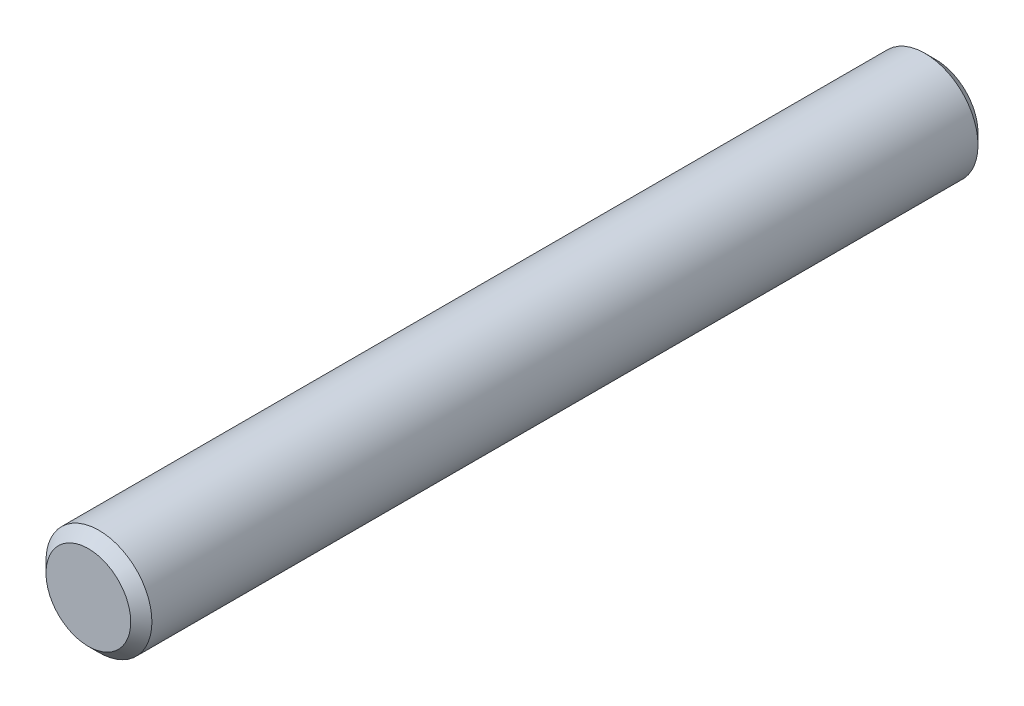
ISO-10303-21;
HEADER;
FILE_DESCRIPTION(('STEP AP214'),'2;1');
FILE_NAME('part.step','',(''),(''),'','','');
FILE_SCHEMA(('AUTOMOTIVE_DESIGN { 1 0 10303 214 1 1 1 1 }'));
ENDSEC;
DATA;
#1=APPLICATION_CONTEXT('core data for automotive mechanical design processes');
#2=APPLICATION_PROTOCOL_DEFINITION('international standard','automotive_design',2000,#1);
#3=PRODUCT_CONTEXT('',#1,'mechanical');
#4=PRODUCT('Part','Part','',(#3));
#5=PRODUCT_RELATED_PRODUCT_CATEGORY('part','',(#4));
#6=PRODUCT_DEFINITION_FORMATION('','',#4);
#7=PRODUCT_DEFINITION_CONTEXT('part definition',#1,'design');
#8=PRODUCT_DEFINITION('design','',#6,#7);
#9=PRODUCT_DEFINITION_SHAPE('','',#8);
#10=(LENGTH_UNIT() NAMED_UNIT(*) SI_UNIT(.MILLI.,.METRE.));
#11=(NAMED_UNIT(*) PLANE_ANGLE_UNIT() SI_UNIT($,.RADIAN.));
#12=(NAMED_UNIT(*) SI_UNIT($,.STERADIAN.) SOLID_ANGLE_UNIT());
#13=UNCERTAINTY_MEASURE_WITH_UNIT(LENGTH_MEASURE(1.E-05),#10,'distance_accuracy_value','');
#14=(GEOMETRIC_REPRESENTATION_CONTEXT(3) GLOBAL_UNCERTAINTY_ASSIGNED_CONTEXT((#13)) GLOBAL_UNIT_ASSIGNED_CONTEXT((#10,
#11,#12)) REPRESENTATION_CONTEXT('',''));
#15=CARTESIAN_POINT('',(0.,0.,0.));
#16=DIRECTION('',(0.,0.,1.));
#17=DIRECTION('',(1.,0.,0.));
#18=AXIS2_PLACEMENT_3D('',#15,#16,#17);
#19=CARTESIAN_POINT('',(0.,0.,-8.));
#20=DIRECTION('',(0.,0.,1.));
#21=DIRECTION('',(1.,0.,0.));
#22=AXIS2_PLACEMENT_3D('',#19,#20,#21);
#23=CYLINDRICAL_SURFACE('',#22,1.);
#24=CARTESIAN_POINT('',(0.,0.,-7.8));
#25=DIRECTION('',(0.,0.,1.));
#26=DIRECTION('',(1.,0.,0.));
#27=AXIS2_PLACEMENT_3D('',#24,#25,#26);
#28=CIRCLE('',#27,1.);
#29=CARTESIAN_POINT('',(1.,0.,-7.8));
#30=VERTEX_POINT('',#29);
#31=EDGE_CURVE('E42',#30,#30,#28,.T.);
#32=ORIENTED_EDGE('',*,*,#31,.T.);
#33=EDGE_LOOP('',(#32));
#34=FACE_BOUND('',#33,.T.);
#35=CARTESIAN_POINT('',(0.,0.,7.8));
#36=DIRECTION('',(0.,0.,1.));
#37=DIRECTION('',(1.,0.,0.));
#38=AXIS2_PLACEMENT_3D('',#35,#36,#37);
#39=CIRCLE('',#38,1.);
#40=CARTESIAN_POINT('',(1.,0.,7.8));
#41=VERTEX_POINT('',#40);
#42=EDGE_CURVE('E46',#41,#41,#39,.F.);
#43=ORIENTED_EDGE('',*,*,#42,.T.);
#44=EDGE_LOOP('',(#43));
#45=FACE_BOUND('',#44,.T.);
#46=ADVANCED_FACE('F31',(#34,#45),#23,.T.);
#47=CARTESIAN_POINT('',(0.,0.,-8.));
#48=DIRECTION('',(0.,0.,1.));
#49=DIRECTION('',(1.,0.,0.));
#50=AXIS2_PLACEMENT_3D('',#47,#48,#49);
#51=PLANE('',#50);
#52=CARTESIAN_POINT('',(0.,0.,-8.));
#53=DIRECTION('',(0.,0.,1.));
#54=DIRECTION('',(1.,0.,0.));
#55=AXIS2_PLACEMENT_3D('',#52,#53,#54);
#56=CIRCLE('',#55,0.8);
#57=CARTESIAN_POINT('',(0.799999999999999,0.,-8.));
#58=VERTEX_POINT('',#57);
#59=EDGE_CURVE('E38',#58,#58,#56,.F.);
#60=ORIENTED_EDGE('',*,*,#59,.T.);
#61=EDGE_LOOP('',(#60));
#62=FACE_BOUND('',#61,.T.);
#63=ADVANCED_FACE('F62',(#62),#51,.F.);
#64=CARTESIAN_POINT('',(0.,0.,8.));
#65=DIRECTION('',(0.,0.,1.));
#66=DIRECTION('',(1.,0.,0.));
#67=AXIS2_PLACEMENT_3D('',#64,#65,#66);
#68=PLANE('',#67);
#69=CARTESIAN_POINT('',(0.,0.,8.));
#70=DIRECTION('',(0.,0.,1.));
#71=DIRECTION('',(1.,0.,0.));
#72=AXIS2_PLACEMENT_3D('',#69,#70,#71);
#73=CIRCLE('',#72,0.799999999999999);
#74=CARTESIAN_POINT('',(0.799999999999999,0.,8.));
#75=VERTEX_POINT('',#74);
#76=EDGE_CURVE('E10',#75,#75,#73,.T.);
#77=ORIENTED_EDGE('',*,*,#76,.T.);
#78=EDGE_LOOP('',(#77));
#79=FACE_BOUND('',#78,.T.);
#80=ADVANCED_FACE('F59',(#79),#68,.T.);
#81=CARTESIAN_POINT('',(0.,0.,-7.8));
#82=DIRECTION('',(0.,0.,1.));
#83=DIRECTION('',(1.,0.,0.));
#84=AXIS2_PLACEMENT_3D('',#81,#82,#83);
#85=CONICAL_SURFACE('',#84,1.,0.785398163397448);
#86=CARTESIAN_POINT('',(0.799999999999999,0.,-8.));
#87=CARTESIAN_POINT('',(0.802083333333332,0.,-7.99791666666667));
#88=CARTESIAN_POINT('',(0.804166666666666,0.,-7.99583333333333));
#89=CARTESIAN_POINT('',(0.808333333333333,0.,-7.99166666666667));
#90=CARTESIAN_POINT('',(0.810416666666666,0.,-7.98958333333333));
#91=CARTESIAN_POINT('',(0.814583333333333,0.,-7.98541666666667));
#92=CARTESIAN_POINT('',(0.816666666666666,0.,-7.98333333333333));
#93=CARTESIAN_POINT('',(0.820833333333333,0.,-7.97916666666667));
#94=CARTESIAN_POINT('',(0.822916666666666,0.,-7.97708333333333));
#95=CARTESIAN_POINT('',(0.827083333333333,0.,-7.97291666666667));
#96=CARTESIAN_POINT('',(0.829166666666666,0.,-7.97083333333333));
#97=CARTESIAN_POINT('',(0.833333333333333,0.,-7.96666666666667));
#98=CARTESIAN_POINT('',(0.835416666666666,0.,-7.96458333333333));
#99=CARTESIAN_POINT('',(0.839583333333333,0.,-7.96041666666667));
#100=CARTESIAN_POINT('',(0.841666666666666,0.,-7.95833333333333));
#101=CARTESIAN_POINT('',(0.845833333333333,0.,-7.95416666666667));
#102=CARTESIAN_POINT('',(0.847916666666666,0.,-7.95208333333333));
#103=CARTESIAN_POINT('',(0.852083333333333,0.,-7.94791666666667));
#104=CARTESIAN_POINT('',(0.854166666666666,0.,-7.94583333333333));
#105=CARTESIAN_POINT('',(0.858333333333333,0.,-7.94166666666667));
#106=CARTESIAN_POINT('',(0.860416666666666,0.,-7.93958333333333));
#107=CARTESIAN_POINT('',(0.864583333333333,0.,-7.93541666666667));
#108=CARTESIAN_POINT('',(0.866666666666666,0.,-7.93333333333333));
#109=CARTESIAN_POINT('',(0.870833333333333,0.,-7.92916666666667));
#110=CARTESIAN_POINT('',(0.872916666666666,0.,-7.92708333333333));
#111=CARTESIAN_POINT('',(0.877083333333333,0.,-7.92291666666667));
#112=CARTESIAN_POINT('',(0.879166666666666,0.,-7.92083333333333));
#113=CARTESIAN_POINT('',(0.883333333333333,0.,-7.91666666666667));
#114=CARTESIAN_POINT('',(0.885416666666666,0.,-7.91458333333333));
#115=CARTESIAN_POINT('',(0.889583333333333,0.,-7.91041666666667));
#116=CARTESIAN_POINT('',(0.891666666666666,0.,-7.90833333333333));
#117=CARTESIAN_POINT('',(0.895833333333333,0.,-7.90416666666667));
#118=CARTESIAN_POINT('',(0.897916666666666,0.,-7.90208333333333));
#119=CARTESIAN_POINT('',(0.902083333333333,0.,-7.89791666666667));
#120=CARTESIAN_POINT('',(0.904166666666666,0.,-7.89583333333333));
#121=CARTESIAN_POINT('',(0.908333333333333,0.,-7.89166666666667));
#122=CARTESIAN_POINT('',(0.910416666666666,0.,-7.88958333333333));
#123=CARTESIAN_POINT('',(0.914583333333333,0.,-7.88541666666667));
#124=CARTESIAN_POINT('',(0.916666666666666,0.,-7.88333333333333));
#125=CARTESIAN_POINT('',(0.920833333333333,0.,-7.87916666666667));
#126=CARTESIAN_POINT('',(0.922916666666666,0.,-7.87708333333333));
#127=CARTESIAN_POINT('',(0.927083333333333,0.,-7.87291666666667));
#128=CARTESIAN_POINT('',(0.929166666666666,0.,-7.87083333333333));
#129=CARTESIAN_POINT('',(0.933333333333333,0.,-7.86666666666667));
#130=CARTESIAN_POINT('',(0.935416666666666,0.,-7.86458333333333));
#131=CARTESIAN_POINT('',(0.939583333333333,0.,-7.86041666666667));
#132=CARTESIAN_POINT('',(0.941666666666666,0.,-7.85833333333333));
#133=CARTESIAN_POINT('',(0.945833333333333,0.,-7.85416666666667));
#134=CARTESIAN_POINT('',(0.947916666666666,0.,-7.85208333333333));
#135=CARTESIAN_POINT('',(0.952083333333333,0.,-7.84791666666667));
#136=CARTESIAN_POINT('',(0.954166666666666,0.,-7.84583333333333));
#137=CARTESIAN_POINT('',(0.958333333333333,0.,-7.84166666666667));
#138=CARTESIAN_POINT('',(0.960416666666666,0.,-7.83958333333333));
#139=CARTESIAN_POINT('',(0.964583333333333,0.,-7.83541666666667));
#140=CARTESIAN_POINT('',(0.966666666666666,0.,-7.83333333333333));
#141=CARTESIAN_POINT('',(0.970833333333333,0.,-7.82916666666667));
#142=CARTESIAN_POINT('',(0.972916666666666,0.,-7.82708333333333));
#143=CARTESIAN_POINT('',(0.977083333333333,0.,-7.82291666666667));
#144=CARTESIAN_POINT('',(0.979166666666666,0.,-7.82083333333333));
#145=CARTESIAN_POINT('',(0.983333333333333,0.,-7.81666666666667));
#146=CARTESIAN_POINT('',(0.985416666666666,0.,-7.81458333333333));
#147=CARTESIAN_POINT('',(0.989583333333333,0.,-7.81041666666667));
#148=CARTESIAN_POINT('',(0.991666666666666,0.,-7.80833333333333));
#149=CARTESIAN_POINT('',(0.995833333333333,0.,-7.80416666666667));
#150=CARTESIAN_POINT('',(0.997916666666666,0.,-7.80208333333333));
#151=CARTESIAN_POINT('',(1.,0.,-7.8));
#152=B_SPLINE_CURVE_WITH_KNOTS('',3,(#86,#87,#88,#89,#90,#91,#92,#93,#94,#95,#96,#97,#98,#99,
#100,#101,#102,#103,#104,#105,#106,#107,#108,#109,#110,#111,#112,#113,#114,#115,#116,#117,#118,
#119,#120,#121,#122,#123,#124,#125,#126,#127,#128,#129,#130,#131,#132,#133,#134,#135,#136,#137,
#138,#139,#140,#141,#142,#143,#144,#145,#146,#147,#148,#149,#150,#151),.UNSPECIFIED.,.F.,.F.,(4,
2,2,2,2,2,2,2,2,2,2,2,2,2,2,2,2,2,2,2,2,2,2,2,2,2,2,2,2,2,2,2,4),(0.,0.00883883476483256,
0.0176776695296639,0.0265165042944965,0.0353553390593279,0.0441941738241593,0.0530330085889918,
0.0618718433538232,0.0707106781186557,0.0795495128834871,0.0883883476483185,0.0972271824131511,
0.106066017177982,0.114904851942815,0.123743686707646,0.132582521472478,0.14142135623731,
0.150260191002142,0.159099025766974,0.167937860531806,0.176776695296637,0.18561553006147,
0.194454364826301,0.203293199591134,0.212132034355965,0.220970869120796,0.229809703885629,
0.23864853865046,0.247487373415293,0.256326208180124,0.265165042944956,0.274003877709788,
0.28284271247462),.UNSPECIFIED.);
#153=EDGE_CURVE('BSEAM55',#58,#30,#152,.T.);
#154=ORIENTED_EDGE('',*,*,#59,.F.);
#155=ORIENTED_EDGE('',*,*,#31,.F.);
#156=ORIENTED_EDGE('',*,*,#153,.T.);
#157=ORIENTED_EDGE('',*,*,#153,.F.);
#158=EDGE_LOOP('',(#154,#156,#155,#157));
#159=FACE_BOUND('',#158,.T.);
#160=ADVANCED_FACE('F55',(#159),#85,.T.);
#161=CARTESIAN_POINT('',(0.,0.,8.));
#162=DIRECTION('',(0.,0.,-1.));
#163=DIRECTION('',(-1.,0.,0.));
#164=AXIS2_PLACEMENT_3D('',#161,#162,#163);
#165=CONICAL_SURFACE('',#164,0.799999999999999,0.785398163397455);
#166=ORIENTED_EDGE('',*,*,#42,.F.);
#167=EDGE_LOOP('',(#166));
#168=FACE_BOUND('',#167,.T.);
#169=ORIENTED_EDGE('',*,*,#76,.F.);
#170=EDGE_LOOP('',(#169));
#171=FACE_BOUND('',#170,.T.);
#172=ADVANCED_FACE('F33',(#168,#171),#165,.T.);
#173=CLOSED_SHELL('',(#46,#63,#80,#160,#172));
#174=MANIFOLD_SOLID_BREP('B2',#173);
#175=ADVANCED_BREP_SHAPE_REPRESENTATION('',(#18,#174),#14);
#176=SHAPE_DEFINITION_REPRESENTATION(#9,#175);
ENDSEC;
END-ISO-10303-21;
